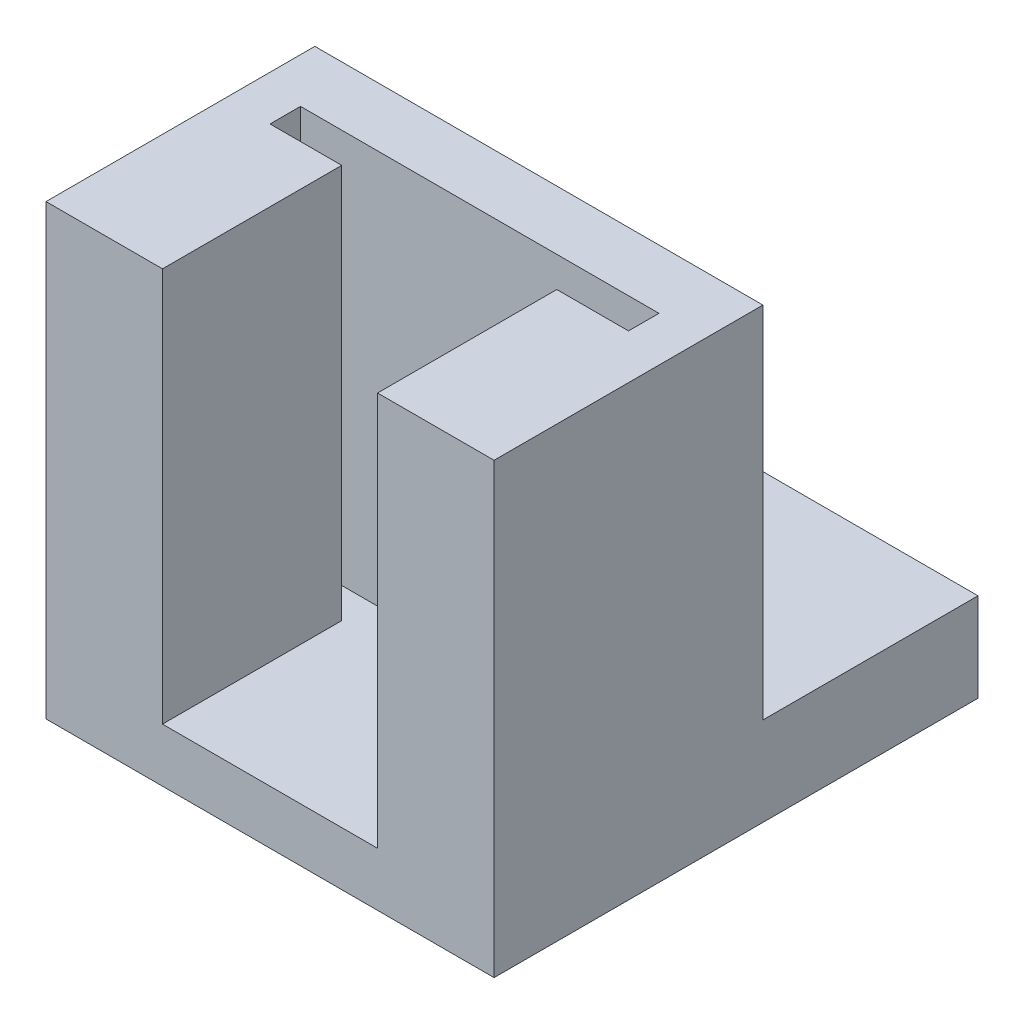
ISO-10303-21;
HEADER;
FILE_DESCRIPTION(('STEP AP214'),'2;1');
FILE_NAME('part.step','',(''),(''),'','','');
FILE_SCHEMA(('AUTOMOTIVE_DESIGN { 1 0 10303 214 1 1 1 1 }'));
ENDSEC;
DATA;
#1=APPLICATION_CONTEXT('core data for automotive mechanical design processes');
#2=APPLICATION_PROTOCOL_DEFINITION('international standard','automotive_design',2000,#1);
#3=PRODUCT_CONTEXT('',#1,'mechanical');
#4=PRODUCT('Part','Part','',(#3));
#5=PRODUCT_RELATED_PRODUCT_CATEGORY('part','',(#4));
#6=PRODUCT_DEFINITION_FORMATION('','',#4);
#7=PRODUCT_DEFINITION_CONTEXT('part definition',#1,'design');
#8=PRODUCT_DEFINITION('design','',#6,#7);
#9=PRODUCT_DEFINITION_SHAPE('','',#8);
#10=(LENGTH_UNIT() NAMED_UNIT(*) SI_UNIT(.MILLI.,.METRE.));
#11=(NAMED_UNIT(*) PLANE_ANGLE_UNIT() SI_UNIT($,.RADIAN.));
#12=(NAMED_UNIT(*) SI_UNIT($,.STERADIAN.) SOLID_ANGLE_UNIT());
#13=UNCERTAINTY_MEASURE_WITH_UNIT(LENGTH_MEASURE(1.E-05),#10,'distance_accuracy_value','');
#14=(GEOMETRIC_REPRESENTATION_CONTEXT(3) GLOBAL_UNCERTAINTY_ASSIGNED_CONTEXT((#13)) GLOBAL_UNIT_ASSIGNED_CONTEXT((#10,
#11,#12)) REPRESENTATION_CONTEXT('',''));
#15=CARTESIAN_POINT('',(0.,0.,0.));
#16=DIRECTION('',(0.,0.,1.));
#17=DIRECTION('',(1.,0.,0.));
#18=AXIS2_PLACEMENT_3D('',#15,#16,#17);
#19=CARTESIAN_POINT('',(12.5,-12.5,15.));
#20=DIRECTION('',(-1.,0.,0.));
#21=DIRECTION('',(0.,0.,1.));
#22=AXIS2_PLACEMENT_3D('',#19,#20,#21);
#23=PLANE('',#22);
#24=DIRECTION('',(0.,0.,-1.));
#25=VECTOR('',#24,1.);
#26=CARTESIAN_POINT('',(12.5,-12.5,15.));
#27=LINE('',#26,#25);
#28=CARTESIAN_POINT('',(12.5,-12.5,15.));
#29=VERTEX_POINT('',#28);
#30=CARTESIAN_POINT('',(12.5,-12.5,-12.));
#31=VERTEX_POINT('',#30);
#32=EDGE_CURVE('E154',#29,#31,#27,.T.);
#33=ORIENTED_EDGE('',*,*,#32,.T.);
#34=DIRECTION('',(0.,-1.,0.));
#35=VECTOR('',#34,1.);
#36=CARTESIAN_POINT('',(12.5,-12.5,-12.));
#37=LINE('',#36,#35);
#38=CARTESIAN_POINT('',(12.5,-7.54809897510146,-12.));
#39=VERTEX_POINT('',#38);
#40=EDGE_CURVE('E169',#39,#31,#37,.T.);
#41=ORIENTED_EDGE('',*,*,#40,.F.);
#42=DIRECTION('',(0.,0.,1.));
#43=VECTOR('',#42,1.);
#44=CARTESIAN_POINT('',(12.5,-7.54809897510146,-12.));
#45=LINE('',#44,#43);
#46=CARTESIAN_POINT('',(12.5,-7.54809897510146,0.));
#47=VERTEX_POINT('',#46);
#48=EDGE_CURVE('E178',#39,#47,#45,.T.);
#49=ORIENTED_EDGE('',*,*,#48,.T.);
#50=DIRECTION('',(0.,1.,0.));
#51=VECTOR('',#50,1.);
#52=CARTESIAN_POINT('',(12.5,-12.5,0.));
#53=LINE('',#52,#51);
#54=CARTESIAN_POINT('',(12.5,12.5,0.));
#55=VERTEX_POINT('',#54);
#56=EDGE_CURVE('E244',#47,#55,#53,.T.);
#57=ORIENTED_EDGE('',*,*,#56,.T.);
#58=DIRECTION('',(0.,0.,-1.));
#59=VECTOR('',#58,1.);
#60=CARTESIAN_POINT('',(12.5,12.5,15.));
#61=LINE('',#60,#59);
#62=CARTESIAN_POINT('',(12.5,12.5,15.));
#63=VERTEX_POINT('',#62);
#64=EDGE_CURVE('E11',#63,#55,#61,.T.);
#65=ORIENTED_EDGE('',*,*,#64,.F.);
#66=DIRECTION('',(0.,1.,0.));
#67=VECTOR('',#66,1.);
#68=CARTESIAN_POINT('',(12.5,-12.5,15.));
#69=LINE('',#68,#67);
#70=EDGE_CURVE('E266',#29,#63,#69,.T.);
#71=ORIENTED_EDGE('',*,*,#70,.F.);
#72=EDGE_LOOP('',(#33,#41,#49,#57,#65,#71));
#73=FACE_BOUND('',#72,.T.);
#74=ADVANCED_FACE('F39',(#73),#23,.F.);
#75=CARTESIAN_POINT('',(-12.5,12.5,15.));
#76=DIRECTION('',(0.,-1.,0.));
#77=DIRECTION('',(0.,0.,-1.));
#78=AXIS2_PLACEMENT_3D('',#75,#76,#77);
#79=PLANE('',#78);
#80=DIRECTION('',(1.,0.,0.));
#81=VECTOR('',#80,1.);
#82=CARTESIAN_POINT('',(6.,12.5,5.));
#83=LINE('',#82,#81);
#84=CARTESIAN_POINT('',(6.,12.5,5.));
#85=VERTEX_POINT('',#84);
#86=CARTESIAN_POINT('',(10.,12.5,5.));
#87=VERTEX_POINT('',#86);
#88=EDGE_CURVE('E230',#85,#87,#83,.T.);
#89=ORIENTED_EDGE('',*,*,#88,.F.);
#90=DIRECTION('',(0.,0.,-1.));
#91=VECTOR('',#90,1.);
#92=CARTESIAN_POINT('',(6.,12.5,15.));
#93=LINE('',#92,#91);
#94=CARTESIAN_POINT('',(6.,12.5,15.));
#95=VERTEX_POINT('',#94);
#96=EDGE_CURVE('E226',#95,#85,#93,.T.);
#97=ORIENTED_EDGE('',*,*,#96,.F.);
#98=DIRECTION('',(-1.,0.,0.));
#99=VECTOR('',#98,1.);
#100=CARTESIAN_POINT('',(-12.5,12.5,15.));
#101=LINE('',#100,#99);
#102=EDGE_CURVE('E272',#63,#95,#101,.T.);
#103=ORIENTED_EDGE('',*,*,#102,.F.);
#104=ORIENTED_EDGE('',*,*,#64,.T.);
#105=DIRECTION('',(-1.,0.,0.));
#106=VECTOR('',#105,1.);
#107=CARTESIAN_POINT('',(-12.5,12.5,0.));
#108=LINE('',#107,#106);
#109=CARTESIAN_POINT('',(-12.5,12.5,0.));
#110=VERTEX_POINT('',#109);
#111=EDGE_CURVE('E283',#55,#110,#108,.T.);
#112=ORIENTED_EDGE('',*,*,#111,.T.);
#113=DIRECTION('',(0.,0.,-1.));
#114=VECTOR('',#113,1.);
#115=CARTESIAN_POINT('',(-12.5,12.5,15.));
#116=LINE('',#115,#114);
#117=CARTESIAN_POINT('',(-12.5,12.5,15.));
#118=VERTEX_POINT('',#117);
#119=EDGE_CURVE('E47',#118,#110,#116,.T.);
#120=ORIENTED_EDGE('',*,*,#119,.F.);
#121=CARTESIAN_POINT('',(-6.,12.5,15.));
#122=VERTEX_POINT('',#121);
#123=EDGE_CURVE('E270',#122,#118,#101,.T.);
#124=ORIENTED_EDGE('',*,*,#123,.F.);
#125=DIRECTION('',(0.,0.,1.));
#126=VECTOR('',#125,1.);
#127=CARTESIAN_POINT('',(-6.,12.5,15.));
#128=LINE('',#127,#126);
#129=CARTESIAN_POINT('',(-6.,12.5,5.));
#130=VERTEX_POINT('',#129);
#131=EDGE_CURVE('E223',#130,#122,#128,.T.);
#132=ORIENTED_EDGE('',*,*,#131,.F.);
#133=DIRECTION('',(1.,0.,0.));
#134=VECTOR('',#133,1.);
#135=CARTESIAN_POINT('',(-10.,12.5,5.));
#136=LINE('',#135,#134);
#137=CARTESIAN_POINT('',(-10.,12.5,5.));
#138=VERTEX_POINT('',#137);
#139=EDGE_CURVE('E219',#138,#130,#136,.T.);
#140=ORIENTED_EDGE('',*,*,#139,.F.);
#141=DIRECTION('',(0.,0.,1.));
#142=VECTOR('',#141,1.);
#143=CARTESIAN_POINT('',(-10.,12.5,5.));
#144=LINE('',#143,#142);
#145=CARTESIAN_POINT('',(-10.,12.5,3.3));
#146=VERTEX_POINT('',#145);
#147=EDGE_CURVE('E185',#146,#138,#144,.T.);
#148=ORIENTED_EDGE('',*,*,#147,.F.);
#149=DIRECTION('',(-1.,0.,0.));
#150=VECTOR('',#149,1.);
#151=CARTESIAN_POINT('',(-10.,12.5,3.3));
#152=LINE('',#151,#150);
#153=CARTESIAN_POINT('',(10.,12.5,3.3));
#154=VERTEX_POINT('',#153);
#155=EDGE_CURVE('E191',#154,#146,#152,.T.);
#156=ORIENTED_EDGE('',*,*,#155,.F.);
#157=DIRECTION('',(0.,0.,-1.));
#158=VECTOR('',#157,1.);
#159=CARTESIAN_POINT('',(10.,12.5,5.));
#160=LINE('',#159,#158);
#161=EDGE_CURVE('E234',#87,#154,#160,.T.);
#162=ORIENTED_EDGE('',*,*,#161,.F.);
#163=EDGE_LOOP('',(#89,#97,#103,#104,#112,#120,#124,#132,#140,#148,#156,#162));
#164=FACE_BOUND('',#163,.T.);
#165=ADVANCED_FACE('F298',(#164),#79,.F.);
#166=CARTESIAN_POINT('',(-12.5,-12.5,15.));
#167=DIRECTION('',(1.,0.,0.));
#168=DIRECTION('',(0.,0.,-1.));
#169=AXIS2_PLACEMENT_3D('',#166,#167,#168);
#170=PLANE('',#169);
#171=DIRECTION('',(0.,-1.,0.));
#172=VECTOR('',#171,1.);
#173=CARTESIAN_POINT('',(-12.5,-12.5,0.));
#174=LINE('',#173,#172);
#175=CARTESIAN_POINT('',(-12.5,-7.54809897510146,0.));
#176=VERTEX_POINT('',#175);
#177=EDGE_CURVE('E271',#110,#176,#174,.T.);
#178=ORIENTED_EDGE('',*,*,#177,.T.);
#179=DIRECTION('',(0.,0.,1.));
#180=VECTOR('',#179,1.);
#181=CARTESIAN_POINT('',(-12.5,-7.54809897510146,-12.));
#182=LINE('',#181,#180);
#183=CARTESIAN_POINT('',(-12.5,-7.54809897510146,-12.));
#184=VERTEX_POINT('',#183);
#185=EDGE_CURVE('E160',#184,#176,#182,.T.);
#186=ORIENTED_EDGE('',*,*,#185,.F.);
#187=DIRECTION('',(0.,1.,0.));
#188=VECTOR('',#187,1.);
#189=CARTESIAN_POINT('',(-12.5,-12.5,-12.));
#190=LINE('',#189,#188);
#191=CARTESIAN_POINT('',(-12.5,-12.5,-12.));
#192=VERTEX_POINT('',#191);
#193=EDGE_CURVE('E157',#192,#184,#190,.T.);
#194=ORIENTED_EDGE('',*,*,#193,.F.);
#195=DIRECTION('',(0.,0.,-1.));
#196=VECTOR('',#195,1.);
#197=CARTESIAN_POINT('',(-12.5,-12.5,15.));
#198=LINE('',#197,#196);
#199=CARTESIAN_POINT('',(-12.5,-12.5,15.));
#200=VERTEX_POINT('',#199);
#201=EDGE_CURVE('E144',#200,#192,#198,.T.);
#202=ORIENTED_EDGE('',*,*,#201,.F.);
#203=DIRECTION('',(0.,-1.,0.));
#204=VECTOR('',#203,1.);
#205=CARTESIAN_POINT('',(-12.5,-12.5,15.));
#206=LINE('',#205,#204);
#207=EDGE_CURVE('E276',#118,#200,#206,.T.);
#208=ORIENTED_EDGE('',*,*,#207,.F.);
#209=ORIENTED_EDGE('',*,*,#119,.T.);
#210=EDGE_LOOP('',(#178,#186,#194,#202,#208,#209));
#211=FACE_BOUND('',#210,.T.);
#212=ADVANCED_FACE('F158',(#211),#170,.F.);
#213=CARTESIAN_POINT('',(-12.5,-12.5,15.));
#214=DIRECTION('',(0.,1.,0.));
#215=DIRECTION('',(0.,0.,1.));
#216=AXIS2_PLACEMENT_3D('',#213,#214,#215);
#217=PLANE('',#216);
#218=ORIENTED_EDGE('',*,*,#201,.T.);
#219=DIRECTION('',(-1.,0.,0.));
#220=VECTOR('',#219,1.);
#221=CARTESIAN_POINT('',(12.5,-12.5,-12.));
#222=LINE('',#221,#220);
#223=EDGE_CURVE('E149',#31,#192,#222,.T.);
#224=ORIENTED_EDGE('',*,*,#223,.F.);
#225=ORIENTED_EDGE('',*,*,#32,.F.);
#226=DIRECTION('',(1.,0.,0.));
#227=VECTOR('',#226,1.);
#228=CARTESIAN_POINT('',(-12.5,-12.5,15.));
#229=LINE('',#228,#227);
#230=EDGE_CURVE('E150',#200,#29,#229,.T.);
#231=ORIENTED_EDGE('',*,*,#230,.F.);
#232=EDGE_LOOP('',(#218,#224,#225,#231));
#233=FACE_BOUND('',#232,.T.);
#234=ADVANCED_FACE('F146',(#233),#217,.F.);
#235=CARTESIAN_POINT('',(0.,0.,15.));
#236=DIRECTION('',(0.,0.,-1.));
#237=DIRECTION('',(-1.,0.,0.));
#238=AXIS2_PLACEMENT_3D('',#235,#236,#237);
#239=PLANE('',#238);
#240=ORIENTED_EDGE('',*,*,#102,.T.);
#241=DIRECTION('',(0.,1.,0.));
#242=VECTOR('',#241,1.);
#243=CARTESIAN_POINT('',(6.,-9.5,15.));
#244=LINE('',#243,#242);
#245=CARTESIAN_POINT('',(6.,-9.5,15.));
#246=VERTEX_POINT('',#245);
#247=EDGE_CURVE('E254',#246,#95,#244,.T.);
#248=ORIENTED_EDGE('',*,*,#247,.F.);
#249=DIRECTION('',(1.,0.,0.));
#250=VECTOR('',#249,1.);
#251=CARTESIAN_POINT('',(6.,-9.5,15.));
#252=LINE('',#251,#250);
#253=CARTESIAN_POINT('',(-6.,-9.5,15.));
#254=VERTEX_POINT('',#253);
#255=EDGE_CURVE('E196',#254,#246,#252,.T.);
#256=ORIENTED_EDGE('',*,*,#255,.F.);
#257=DIRECTION('',(0.,1.,0.));
#258=VECTOR('',#257,1.);
#259=CARTESIAN_POINT('',(-6.,-9.5,15.));
#260=LINE('',#259,#258);
#261=EDGE_CURVE('E257',#254,#122,#260,.T.);
#262=ORIENTED_EDGE('',*,*,#261,.T.);
#263=ORIENTED_EDGE('',*,*,#123,.T.);
#264=ORIENTED_EDGE('',*,*,#207,.T.);
#265=ORIENTED_EDGE('',*,*,#230,.T.);
#266=ORIENTED_EDGE('',*,*,#70,.T.);
#267=EDGE_LOOP('',(#240,#248,#256,#262,#263,#264,#265,#266));
#268=FACE_BOUND('',#267,.T.);
#269=ADVANCED_FACE('F326',(#268),#239,.F.);
#270=CARTESIAN_POINT('',(0.,0.,0.));
#271=DIRECTION('',(0.,0.,-1.));
#272=DIRECTION('',(-1.,0.,0.));
#273=AXIS2_PLACEMENT_3D('',#270,#271,#272);
#274=PLANE('',#273);
#275=DIRECTION('',(1.,0.,0.));
#276=VECTOR('',#275,1.);
#277=CARTESIAN_POINT('',(12.5,-7.54809897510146,0.));
#278=LINE('',#277,#276);
#279=EDGE_CURVE('E54',#176,#47,#278,.T.);
#280=ORIENTED_EDGE('',*,*,#279,.F.);
#281=ORIENTED_EDGE('',*,*,#177,.F.);
#282=ORIENTED_EDGE('',*,*,#111,.F.);
#283=ORIENTED_EDGE('',*,*,#56,.F.);
#284=EDGE_LOOP('',(#280,#281,#282,#283));
#285=FACE_BOUND('',#284,.T.);
#286=ADVANCED_FACE('F295',(#285),#274,.T.);
#287=CARTESIAN_POINT('',(-10.,-9.5,5.));
#288=DIRECTION('',(-1.,0.,0.));
#289=DIRECTION('',(0.,0.,1.));
#290=AXIS2_PLACEMENT_3D('',#287,#288,#289);
#291=PLANE('',#290);
#292=ORIENTED_EDGE('',*,*,#147,.T.);
#293=DIRECTION('',(0.,1.,0.));
#294=VECTOR('',#293,1.);
#295=CARTESIAN_POINT('',(-10.,-9.5,5.));
#296=LINE('',#295,#294);
#297=CARTESIAN_POINT('',(-10.,-9.5,5.));
#298=VERTEX_POINT('',#297);
#299=EDGE_CURVE('E215',#298,#138,#296,.T.);
#300=ORIENTED_EDGE('',*,*,#299,.F.);
#301=DIRECTION('',(0.,0.,1.));
#302=VECTOR('',#301,1.);
#303=CARTESIAN_POINT('',(-10.,-9.5,5.));
#304=LINE('',#303,#302);
#305=CARTESIAN_POINT('',(-10.,-9.5,3.3));
#306=VERTEX_POINT('',#305);
#307=EDGE_CURVE('E186',#306,#298,#304,.T.);
#308=ORIENTED_EDGE('',*,*,#307,.F.);
#309=DIRECTION('',(0.,1.,0.));
#310=VECTOR('',#309,1.);
#311=CARTESIAN_POINT('',(-10.,-9.5,3.3));
#312=LINE('',#311,#310);
#313=EDGE_CURVE('E241',#306,#146,#312,.T.);
#314=ORIENTED_EDGE('',*,*,#313,.T.);
#315=EDGE_LOOP('',(#292,#300,#308,#314));
#316=FACE_BOUND('',#315,.T.);
#317=ADVANCED_FACE('F329',(#316),#291,.F.);
#318=CARTESIAN_POINT('',(-10.,-9.5,3.3));
#319=DIRECTION('',(0.,0.,-1.));
#320=DIRECTION('',(-1.,0.,0.));
#321=AXIS2_PLACEMENT_3D('',#318,#319,#320);
#322=PLANE('',#321);
#323=ORIENTED_EDGE('',*,*,#155,.T.);
#324=ORIENTED_EDGE('',*,*,#313,.F.);
#325=DIRECTION('',(-1.,0.,0.));
#326=VECTOR('',#325,1.);
#327=CARTESIAN_POINT('',(-10.,-9.5,3.3));
#328=LINE('',#327,#326);
#329=CARTESIAN_POINT('',(10.,-9.5,3.3));
#330=VERTEX_POINT('',#329);
#331=EDGE_CURVE('E211',#330,#306,#328,.T.);
#332=ORIENTED_EDGE('',*,*,#331,.F.);
#333=DIRECTION('',(0.,1.,0.));
#334=VECTOR('',#333,1.);
#335=CARTESIAN_POINT('',(10.,-9.5,3.3));
#336=LINE('',#335,#334);
#337=EDGE_CURVE('E245',#330,#154,#336,.T.);
#338=ORIENTED_EDGE('',*,*,#337,.T.);
#339=EDGE_LOOP('',(#323,#324,#332,#338));
#340=FACE_BOUND('',#339,.T.);
#341=ADVANCED_FACE('F335',(#340),#322,.F.);
#342=CARTESIAN_POINT('',(10.,-9.5,5.));
#343=DIRECTION('',(1.,0.,0.));
#344=DIRECTION('',(0.,0.,-1.));
#345=AXIS2_PLACEMENT_3D('',#342,#343,#344);
#346=PLANE('',#345);
#347=ORIENTED_EDGE('',*,*,#161,.T.);
#348=ORIENTED_EDGE('',*,*,#337,.F.);
#349=DIRECTION('',(0.,0.,-1.));
#350=VECTOR('',#349,1.);
#351=CARTESIAN_POINT('',(10.,-9.5,5.));
#352=LINE('',#351,#350);
#353=CARTESIAN_POINT('',(10.,-9.5,5.));
#354=VERTEX_POINT('',#353);
#355=EDGE_CURVE('E207',#354,#330,#352,.T.);
#356=ORIENTED_EDGE('',*,*,#355,.F.);
#357=DIRECTION('',(0.,1.,0.));
#358=VECTOR('',#357,1.);
#359=CARTESIAN_POINT('',(10.,-9.5,5.));
#360=LINE('',#359,#358);
#361=EDGE_CURVE('E248',#354,#87,#360,.T.);
#362=ORIENTED_EDGE('',*,*,#361,.T.);
#363=EDGE_LOOP('',(#347,#348,#356,#362));
#364=FACE_BOUND('',#363,.T.);
#365=ADVANCED_FACE('F351',(#364),#346,.F.);
#366=CARTESIAN_POINT('',(6.,-9.5,5.));
#367=DIRECTION('',(0.,0.,1.));
#368=DIRECTION('',(1.,0.,0.));
#369=AXIS2_PLACEMENT_3D('',#366,#367,#368);
#370=PLANE('',#369);
#371=ORIENTED_EDGE('',*,*,#88,.T.);
#372=ORIENTED_EDGE('',*,*,#361,.F.);
#373=DIRECTION('',(1.,0.,0.));
#374=VECTOR('',#373,1.);
#375=CARTESIAN_POINT('',(6.,-9.5,5.));
#376=LINE('',#375,#374);
#377=CARTESIAN_POINT('',(6.,-9.5,5.));
#378=VERTEX_POINT('',#377);
#379=EDGE_CURVE('E203',#378,#354,#376,.T.);
#380=ORIENTED_EDGE('',*,*,#379,.F.);
#381=DIRECTION('',(0.,1.,0.));
#382=VECTOR('',#381,1.);
#383=CARTESIAN_POINT('',(6.,-9.5,5.));
#384=LINE('',#383,#382);
#385=EDGE_CURVE('E251',#378,#85,#384,.T.);
#386=ORIENTED_EDGE('',*,*,#385,.T.);
#387=EDGE_LOOP('',(#371,#372,#380,#386));
#388=FACE_BOUND('',#387,.T.);
#389=ADVANCED_FACE('F347',(#388),#370,.F.);
#390=CARTESIAN_POINT('',(6.,-9.5,15.));
#391=DIRECTION('',(1.,0.,0.));
#392=DIRECTION('',(0.,0.,-1.));
#393=AXIS2_PLACEMENT_3D('',#390,#391,#392);
#394=PLANE('',#393);
#395=ORIENTED_EDGE('',*,*,#96,.T.);
#396=ORIENTED_EDGE('',*,*,#385,.F.);
#397=DIRECTION('',(0.,0.,-1.));
#398=VECTOR('',#397,1.);
#399=CARTESIAN_POINT('',(6.,-9.5,15.));
#400=LINE('',#399,#398);
#401=EDGE_CURVE('E199',#246,#378,#400,.T.);
#402=ORIENTED_EDGE('',*,*,#401,.F.);
#403=ORIENTED_EDGE('',*,*,#247,.T.);
#404=EDGE_LOOP('',(#395,#396,#402,#403));
#405=FACE_BOUND('',#404,.T.);
#406=ADVANCED_FACE('F343',(#405),#394,.F.);
#407=CARTESIAN_POINT('',(-6.,-9.5,15.));
#408=DIRECTION('',(-1.,0.,0.));
#409=DIRECTION('',(0.,0.,1.));
#410=AXIS2_PLACEMENT_3D('',#407,#408,#409);
#411=PLANE('',#410);
#412=ORIENTED_EDGE('',*,*,#131,.T.);
#413=ORIENTED_EDGE('',*,*,#261,.F.);
#414=DIRECTION('',(0.,0.,1.));
#415=VECTOR('',#414,1.);
#416=CARTESIAN_POINT('',(-6.,-9.5,15.));
#417=LINE('',#416,#415);
#418=CARTESIAN_POINT('',(-6.,-9.5,5.));
#419=VERTEX_POINT('',#418);
#420=EDGE_CURVE('E62',#419,#254,#417,.T.);
#421=ORIENTED_EDGE('',*,*,#420,.F.);
#422=DIRECTION('',(0.,1.,0.));
#423=VECTOR('',#422,1.);
#424=CARTESIAN_POINT('',(-6.,-9.5,5.));
#425=LINE('',#424,#423);
#426=EDGE_CURVE('E261',#419,#130,#425,.T.);
#427=ORIENTED_EDGE('',*,*,#426,.T.);
#428=EDGE_LOOP('',(#412,#413,#421,#427));
#429=FACE_BOUND('',#428,.T.);
#430=ADVANCED_FACE('F339',(#429),#411,.F.);
#431=CARTESIAN_POINT('',(-10.,-9.5,5.));
#432=DIRECTION('',(0.,0.,1.));
#433=DIRECTION('',(1.,0.,0.));
#434=AXIS2_PLACEMENT_3D('',#431,#432,#433);
#435=PLANE('',#434);
#436=ORIENTED_EDGE('',*,*,#139,.T.);
#437=ORIENTED_EDGE('',*,*,#426,.F.);
#438=DIRECTION('',(1.,0.,0.));
#439=VECTOR('',#438,1.);
#440=CARTESIAN_POINT('',(-10.,-9.5,5.));
#441=LINE('',#440,#439);
#442=EDGE_CURVE('E190',#298,#419,#441,.T.);
#443=ORIENTED_EDGE('',*,*,#442,.F.);
#444=ORIENTED_EDGE('',*,*,#299,.T.);
#445=EDGE_LOOP('',(#436,#437,#443,#444));
#446=FACE_BOUND('',#445,.T.);
#447=ADVANCED_FACE('F313',(#446),#435,.F.);
#448=CARTESIAN_POINT('',(0.,-9.5,0.));
#449=DIRECTION('',(0.,-1.,0.));
#450=DIRECTION('',(0.,0.,-1.));
#451=AXIS2_PLACEMENT_3D('',#448,#449,#450);
#452=PLANE('',#451);
#453=ORIENTED_EDGE('',*,*,#307,.T.);
#454=ORIENTED_EDGE('',*,*,#442,.T.);
#455=ORIENTED_EDGE('',*,*,#420,.T.);
#456=ORIENTED_EDGE('',*,*,#255,.T.);
#457=ORIENTED_EDGE('',*,*,#401,.T.);
#458=ORIENTED_EDGE('',*,*,#379,.T.);
#459=ORIENTED_EDGE('',*,*,#355,.T.);
#460=ORIENTED_EDGE('',*,*,#331,.T.);
#461=EDGE_LOOP('',(#453,#454,#455,#456,#457,#458,#459,#460));
#462=FACE_BOUND('',#461,.T.);
#463=ADVANCED_FACE('F306',(#462),#452,.F.);
#464=CARTESIAN_POINT('',(12.5,-7.54809897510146,-12.));
#465=DIRECTION('',(0.,-1.,0.));
#466=DIRECTION('',(1.,0.,0.));
#467=AXIS2_PLACEMENT_3D('',#464,#465,#466);
#468=PLANE('',#467);
#469=ORIENTED_EDGE('',*,*,#279,.T.);
#470=ORIENTED_EDGE('',*,*,#48,.F.);
#471=DIRECTION('',(1.,0.,0.));
#472=VECTOR('',#471,1.);
#473=CARTESIAN_POINT('',(12.5,-7.54809897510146,-12.));
#474=LINE('',#473,#472);
#475=EDGE_CURVE('E164',#184,#39,#474,.T.);
#476=ORIENTED_EDGE('',*,*,#475,.F.);
#477=ORIENTED_EDGE('',*,*,#185,.T.);
#478=EDGE_LOOP('',(#469,#470,#476,#477));
#479=FACE_BOUND('',#478,.T.);
#480=ADVANCED_FACE('F304',(#479),#468,.F.);
#481=CARTESIAN_POINT('',(0.,0.,-12.));
#482=DIRECTION('',(0.,0.,-1.));
#483=DIRECTION('',(-1.,0.,0.));
#484=AXIS2_PLACEMENT_3D('',#481,#482,#483);
#485=PLANE('',#484);
#486=ORIENTED_EDGE('',*,*,#223,.T.);
#487=ORIENTED_EDGE('',*,*,#193,.T.);
#488=ORIENTED_EDGE('',*,*,#475,.T.);
#489=ORIENTED_EDGE('',*,*,#40,.T.);
#490=EDGE_LOOP('',(#486,#487,#488,#489));
#491=FACE_BOUND('',#490,.T.);
#492=ADVANCED_FACE('F167',(#491),#485,.T.);
#493=CLOSED_SHELL('',(#74,#165,#212,#234,#269,#286,#317,#341,#365,#389,#406,#430,#447,#463,#480,#492));
#494=MANIFOLD_SOLID_BREP('B2',#493);
#495=ADVANCED_BREP_SHAPE_REPRESENTATION('',(#18,#494),#14);
#496=SHAPE_DEFINITION_REPRESENTATION(#9,#495);
ENDSEC;
END-ISO-10303-21;
